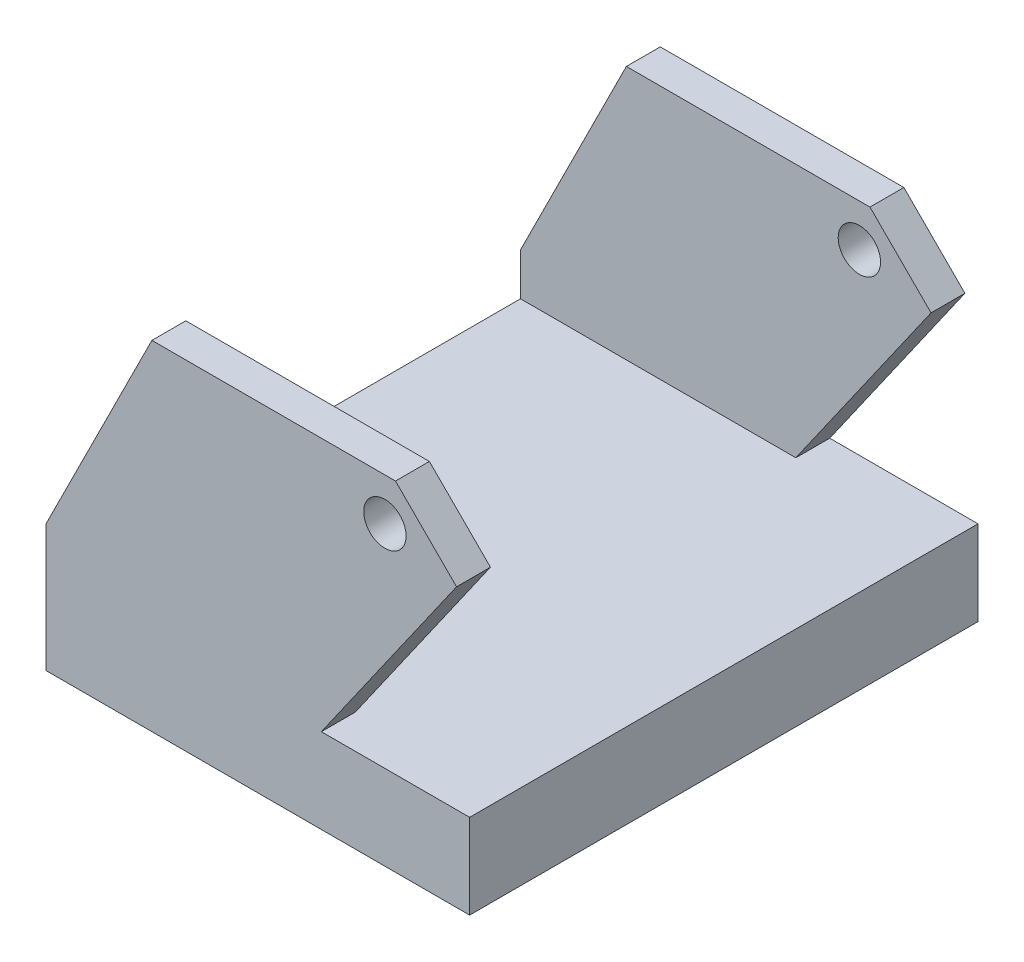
ISO-10303-21;
HEADER;
FILE_DESCRIPTION(('STEP AP214'),'2;1');
FILE_NAME('part.step','',(''),(''),'','','');
FILE_SCHEMA(('AUTOMOTIVE_DESIGN { 1 0 10303 214 1 1 1 1 }'));
ENDSEC;
DATA;
#1=APPLICATION_CONTEXT('core data for automotive mechanical design processes');
#2=APPLICATION_PROTOCOL_DEFINITION('international standard','automotive_design',2000,#1);
#3=PRODUCT_CONTEXT('',#1,'mechanical');
#4=PRODUCT('Part','Part','',(#3));
#5=PRODUCT_RELATED_PRODUCT_CATEGORY('part','',(#4));
#6=PRODUCT_DEFINITION_FORMATION('','',#4);
#7=PRODUCT_DEFINITION_CONTEXT('part definition',#1,'design');
#8=PRODUCT_DEFINITION('design','',#6,#7);
#9=PRODUCT_DEFINITION_SHAPE('','',#8);
#10=(LENGTH_UNIT() NAMED_UNIT(*) SI_UNIT(.MILLI.,.METRE.));
#11=(NAMED_UNIT(*) PLANE_ANGLE_UNIT() SI_UNIT($,.RADIAN.));
#12=(NAMED_UNIT(*) SI_UNIT($,.STERADIAN.) SOLID_ANGLE_UNIT());
#13=UNCERTAINTY_MEASURE_WITH_UNIT(LENGTH_MEASURE(1.E-05),#10,'distance_accuracy_value','');
#14=(GEOMETRIC_REPRESENTATION_CONTEXT(3) GLOBAL_UNCERTAINTY_ASSIGNED_CONTEXT((#13)) GLOBAL_UNIT_ASSIGNED_CONTEXT((#10,
#11,#12)) REPRESENTATION_CONTEXT('',''));
#15=CARTESIAN_POINT('',(0.,0.,0.));
#16=DIRECTION('',(0.,0.,1.));
#17=DIRECTION('',(1.,0.,0.));
#18=AXIS2_PLACEMENT_3D('',#15,#16,#17);
#19=CARTESIAN_POINT('',(50.,0.,-60.));
#20=DIRECTION('',(0.,0.,1.));
#21=DIRECTION('',(1.,0.,0.));
#22=AXIS2_PLACEMENT_3D('',#19,#20,#21);
#23=PLANE('',#22);
#24=CARTESIAN_POINT('',(30.,70.,-60.));
#25=DIRECTION('',(0.,0.,1.));
#26=DIRECTION('',(1.,0.,0.));
#27=AXIS2_PLACEMENT_3D('',#24,#25,#26);
#28=CIRCLE('',#27,5.);
#29=CARTESIAN_POINT('',(35.,70.,-60.));
#30=VERTEX_POINT('',#29);
#31=EDGE_CURVE('E156',#30,#30,#28,.T.);
#32=ORIENTED_EDGE('',*,*,#31,.T.);
#33=EDGE_LOOP('',(#32));
#34=FACE_BOUND('',#33,.T.);
#35=DIRECTION('',(-0.57357643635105,-0.819152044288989,0.));
#36=VECTOR('',#35,1.);
#37=CARTESIAN_POINT('',(46.9173294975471,65.5826705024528,-60.));
#38=LINE('',#37,#36);
#39=CARTESIAN_POINT('',(46.9173294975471,65.5826705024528,-60.));
#40=VERTEX_POINT('',#39);
#41=CARTESIAN_POINT('',(15.,20.,-60.));
#42=VERTEX_POINT('',#41);
#43=EDGE_CURVE('E290',#40,#42,#38,.T.);
#44=ORIENTED_EDGE('',*,*,#43,.T.);
#45=DIRECTION('',(1.,0.,0.));
#46=VECTOR('',#45,1.);
#47=CARTESIAN_POINT('',(15.,20.,-60.));
#48=LINE('',#47,#46);
#49=CARTESIAN_POINT('',(50.,20.,-60.));
#50=VERTEX_POINT('',#49);
#51=EDGE_CURVE('E145',#42,#50,#48,.T.);
#52=ORIENTED_EDGE('',*,*,#51,.T.);
#53=DIRECTION('',(0.,1.,0.));
#54=VECTOR('',#53,1.);
#55=CARTESIAN_POINT('',(50.,0.,-60.));
#56=LINE('',#55,#54);
#57=CARTESIAN_POINT('',(50.,0.,-60.));
#58=VERTEX_POINT('',#57);
#59=EDGE_CURVE('E209',#58,#50,#56,.T.);
#60=ORIENTED_EDGE('',*,*,#59,.F.);
#61=DIRECTION('',(-1.,0.,0.));
#62=VECTOR('',#61,1.);
#63=CARTESIAN_POINT('',(50.,0.,-60.));
#64=LINE('',#63,#62);
#65=CARTESIAN_POINT('',(-50.,0.,-60.));
#66=VERTEX_POINT('',#65);
#67=EDGE_CURVE('E167',#58,#66,#64,.T.);
#68=ORIENTED_EDGE('',*,*,#67,.T.);
#69=DIRECTION('',(0.,1.,0.));
#70=VECTOR('',#69,1.);
#71=CARTESIAN_POINT('',(-50.,0.,-60.));
#72=LINE('',#71,#70);
#73=CARTESIAN_POINT('',(-50.,30.,-60.));
#74=VERTEX_POINT('',#73);
#75=EDGE_CURVE('E198',#66,#74,#72,.T.);
#76=ORIENTED_EDGE('',*,*,#75,.T.);
#77=DIRECTION('',(0.447213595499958,0.894427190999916,0.));
#78=VECTOR('',#77,1.);
#79=CARTESIAN_POINT('',(-25.,80.,-60.));
#80=LINE('',#79,#78);
#81=CARTESIAN_POINT('',(-25.,80.,-60.));
#82=VERTEX_POINT('',#81);
#83=EDGE_CURVE('E189',#74,#82,#80,.T.);
#84=ORIENTED_EDGE('',*,*,#83,.T.);
#85=DIRECTION('',(-1.,0.,0.));
#86=VECTOR('',#85,1.);
#87=CARTESIAN_POINT('',(50.,80.,-60.));
#88=LINE('',#87,#86);
#89=CARTESIAN_POINT('',(32.5,80.,-60.));
#90=VERTEX_POINT('',#89);
#91=EDGE_CURVE('E40',#90,#82,#88,.T.);
#92=ORIENTED_EDGE('',*,*,#91,.F.);
#93=DIRECTION('',(0.707106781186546,-0.707106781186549,0.));
#94=VECTOR('',#93,1.);
#95=CARTESIAN_POINT('',(46.9173294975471,65.5826705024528,-60.));
#96=LINE('',#95,#94);
#97=EDGE_CURVE('E288',#90,#40,#96,.T.);
#98=ORIENTED_EDGE('',*,*,#97,.T.);
#99=EDGE_LOOP('',(#44,#52,#60,#68,#76,#84,#92,#98));
#100=FACE_BOUND('',#99,.T.);
#101=ADVANCED_FACE('F33',(#34,#100),#23,.F.);
#102=CARTESIAN_POINT('',(50.,80.,-60.));
#103=DIRECTION('',(0.,-1.,0.));
#104=DIRECTION('',(0.,0.,-1.));
#105=AXIS2_PLACEMENT_3D('',#102,#103,#104);
#106=PLANE('',#105);
#107=DIRECTION('',(-1.,0.,0.));
#108=VECTOR('',#107,1.);
#109=CARTESIAN_POINT('',(50.,80.,-52.));
#110=LINE('',#109,#108);
#111=CARTESIAN_POINT('',(32.5,80.,-52.));
#112=VERTEX_POINT('',#111);
#113=CARTESIAN_POINT('',(-25.,80.,-52.));
#114=VERTEX_POINT('',#113);
#115=EDGE_CURVE('E174',#112,#114,#110,.T.);
#116=ORIENTED_EDGE('',*,*,#115,.F.);
#117=DIRECTION('',(0.,0.,1.));
#118=VECTOR('',#117,1.);
#119=CARTESIAN_POINT('',(32.5,80.,-60.));
#120=LINE('',#119,#118);
#121=EDGE_CURVE('E144',#90,#112,#120,.T.);
#122=ORIENTED_EDGE('',*,*,#121,.F.);
#123=ORIENTED_EDGE('',*,*,#91,.T.);
#124=DIRECTION('',(0.,0.,1.));
#125=VECTOR('',#124,1.);
#126=CARTESIAN_POINT('',(-25.,80.,-60.));
#127=LINE('',#126,#125);
#128=EDGE_CURVE('E182',#82,#114,#127,.T.);
#129=ORIENTED_EDGE('',*,*,#128,.T.);
#130=EDGE_LOOP('',(#116,#122,#123,#129));
#131=FACE_BOUND('',#130,.T.);
#132=ADVANCED_FACE('F181',(#131),#106,.F.);
#133=CARTESIAN_POINT('',(50.,80.,-52.));
#134=DIRECTION('',(0.,0.,-1.));
#135=DIRECTION('',(0.,1.,0.));
#136=AXIS2_PLACEMENT_3D('',#133,#134,#135);
#137=PLANE('',#136);
#138=CARTESIAN_POINT('',(30.,70.,-52.));
#139=DIRECTION('',(0.,0.,-1.));
#140=DIRECTION('',(0.,1.,0.));
#141=AXIS2_PLACEMENT_3D('',#138,#139,#140);
#142=CIRCLE('',#141,5.);
#143=CARTESIAN_POINT('',(30.,75.,-52.));
#144=VERTEX_POINT('',#143);
#145=EDGE_CURVE('E203',#144,#144,#142,.T.);
#146=ORIENTED_EDGE('',*,*,#145,.T.);
#147=EDGE_LOOP('',(#146));
#148=FACE_BOUND('',#147,.T.);
#149=DIRECTION('',(-1.,0.,0.));
#150=VECTOR('',#149,1.);
#151=CARTESIAN_POINT('',(50.,20.,-52.));
#152=LINE('',#151,#150);
#153=CARTESIAN_POINT('',(15.,20.,-52.));
#154=VERTEX_POINT('',#153);
#155=CARTESIAN_POINT('',(-50.,20.,-52.));
#156=VERTEX_POINT('',#155);
#157=EDGE_CURVE('E172',#154,#156,#152,.T.);
#158=ORIENTED_EDGE('',*,*,#157,.F.);
#159=DIRECTION('',(0.57357643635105,0.819152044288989,0.));
#160=VECTOR('',#159,1.);
#161=CARTESIAN_POINT('',(54.7054261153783,76.7052251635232,-52.));
#162=LINE('',#161,#160);
#163=CARTESIAN_POINT('',(46.9173294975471,65.5826705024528,-52.));
#164=VERTEX_POINT('',#163);
#165=EDGE_CURVE('E246',#154,#164,#162,.T.);
#166=ORIENTED_EDGE('',*,*,#165,.T.);
#167=DIRECTION('',(-0.707106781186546,0.707106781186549,0.));
#168=VECTOR('',#167,1.);
#169=CARTESIAN_POINT('',(41.25,71.25,-52.));
#170=LINE('',#169,#168);
#171=EDGE_CURVE('E245',#164,#112,#170,.T.);
#172=ORIENTED_EDGE('',*,*,#171,.T.);
#173=ORIENTED_EDGE('',*,*,#115,.T.);
#174=DIRECTION('',(-0.447213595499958,-0.894427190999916,0.));
#175=VECTOR('',#174,1.);
#176=CARTESIAN_POINT('',(-10.,110.,-52.));
#177=LINE('',#176,#175);
#178=CARTESIAN_POINT('',(-50.,30.,-52.));
#179=VERTEX_POINT('',#178);
#180=EDGE_CURVE('E192',#114,#179,#177,.T.);
#181=ORIENTED_EDGE('',*,*,#180,.T.);
#182=DIRECTION('',(0.,-1.,0.));
#183=VECTOR('',#182,1.);
#184=CARTESIAN_POINT('',(-50.,80.,-52.));
#185=LINE('',#184,#183);
#186=EDGE_CURVE('E218',#179,#156,#185,.T.);
#187=ORIENTED_EDGE('',*,*,#186,.T.);
#188=EDGE_LOOP('',(#158,#166,#172,#173,#181,#187));
#189=FACE_BOUND('',#188,.T.);
#190=ADVANCED_FACE('F242',(#148,#189),#137,.F.);
#191=CARTESIAN_POINT('',(50.,20.,-52.));
#192=DIRECTION('',(0.,-1.,0.));
#193=DIRECTION('',(0.,0.,-1.));
#194=AXIS2_PLACEMENT_3D('',#191,#192,#193);
#195=PLANE('',#194);
#196=DIRECTION('',(-1.,0.,0.));
#197=VECTOR('',#196,1.);
#198=CARTESIAN_POINT('',(50.,20.,52.));
#199=LINE('',#198,#197);
#200=CARTESIAN_POINT('',(15.,20.,52.));
#201=VERTEX_POINT('',#200);
#202=CARTESIAN_POINT('',(-50.,20.,52.));
#203=VERTEX_POINT('',#202);
#204=EDGE_CURVE('E164',#201,#203,#199,.T.);
#205=ORIENTED_EDGE('',*,*,#204,.F.);
#206=DIRECTION('',(0.,0.,1.));
#207=VECTOR('',#206,1.);
#208=CARTESIAN_POINT('',(15.,20.,-60.));
#209=LINE('',#208,#207);
#210=CARTESIAN_POINT('',(15.,20.,60.));
#211=VERTEX_POINT('',#210);
#212=EDGE_CURVE('E295',#201,#211,#209,.T.);
#213=ORIENTED_EDGE('',*,*,#212,.T.);
#214=DIRECTION('',(1.,0.,0.));
#215=VECTOR('',#214,1.);
#216=CARTESIAN_POINT('',(15.,20.,60.));
#217=LINE('',#216,#215);
#218=CARTESIAN_POINT('',(50.,20.,60.));
#219=VERTEX_POINT('',#218);
#220=EDGE_CURVE('E286',#211,#219,#217,.T.);
#221=ORIENTED_EDGE('',*,*,#220,.T.);
#222=DIRECTION('',(0.,0.,1.));
#223=VECTOR('',#222,1.);
#224=CARTESIAN_POINT('',(50.,20.,-52.));
#225=LINE('',#224,#223);
#226=EDGE_CURVE('E47',#50,#219,#225,.T.);
#227=ORIENTED_EDGE('',*,*,#226,.F.);
#228=ORIENTED_EDGE('',*,*,#51,.F.);
#229=EDGE_CURVE('E253',#42,#154,#209,.T.);
#230=ORIENTED_EDGE('',*,*,#229,.T.);
#231=ORIENTED_EDGE('',*,*,#157,.T.);
#232=DIRECTION('',(0.,0.,1.));
#233=VECTOR('',#232,1.);
#234=CARTESIAN_POINT('',(-50.,20.,-52.));
#235=LINE('',#234,#233);
#236=EDGE_CURVE('E221',#156,#203,#235,.T.);
#237=ORIENTED_EDGE('',*,*,#236,.T.);
#238=EDGE_LOOP('',(#205,#213,#221,#227,#228,#230,#231,#237));
#239=FACE_BOUND('',#238,.T.);
#240=ADVANCED_FACE('F307',(#239),#195,.F.);
#241=CARTESIAN_POINT('',(50.,80.,52.));
#242=DIRECTION('',(0.,0.,1.));
#243=DIRECTION('',(0.,-1.,0.));
#244=AXIS2_PLACEMENT_3D('',#241,#242,#243);
#245=PLANE('',#244);
#246=CARTESIAN_POINT('',(30.,70.,52.));
#247=DIRECTION('',(0.,0.,1.));
#248=DIRECTION('',(0.,-1.,0.));
#249=AXIS2_PLACEMENT_3D('',#246,#247,#248);
#250=CIRCLE('',#249,5.);
#251=CARTESIAN_POINT('',(30.,65.,52.));
#252=VERTEX_POINT('',#251);
#253=EDGE_CURVE('E257',#252,#252,#250,.T.);
#254=ORIENTED_EDGE('',*,*,#253,.T.);
#255=EDGE_LOOP('',(#254));
#256=FACE_BOUND('',#255,.T.);
#257=DIRECTION('',(0.707106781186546,-0.707106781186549,0.));
#258=VECTOR('',#257,1.);
#259=CARTESIAN_POINT('',(41.25,71.25,52.));
#260=LINE('',#259,#258);
#261=CARTESIAN_POINT('',(32.5,80.,52.));
#262=VERTEX_POINT('',#261);
#263=CARTESIAN_POINT('',(46.9173294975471,65.5826705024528,52.));
#264=VERTEX_POINT('',#263);
#265=EDGE_CURVE('E140',#262,#264,#260,.T.);
#266=ORIENTED_EDGE('',*,*,#265,.T.);
#267=DIRECTION('',(-0.57357643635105,-0.819152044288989,0.));
#268=VECTOR('',#267,1.);
#269=CARTESIAN_POINT('',(54.7054261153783,76.7052251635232,52.));
#270=LINE('',#269,#268);
#271=EDGE_CURVE('E249',#264,#201,#270,.T.);
#272=ORIENTED_EDGE('',*,*,#271,.T.);
#273=ORIENTED_EDGE('',*,*,#204,.T.);
#274=DIRECTION('',(0.,1.,0.));
#275=VECTOR('',#274,1.);
#276=CARTESIAN_POINT('',(-50.,80.,52.));
#277=LINE('',#276,#275);
#278=CARTESIAN_POINT('',(-50.,30.,52.));
#279=VERTEX_POINT('',#278);
#280=EDGE_CURVE('E224',#203,#279,#277,.T.);
#281=ORIENTED_EDGE('',*,*,#280,.T.);
#282=DIRECTION('',(0.447213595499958,0.894427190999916,0.));
#283=VECTOR('',#282,1.);
#284=CARTESIAN_POINT('',(-10.,110.,52.));
#285=LINE('',#284,#283);
#286=CARTESIAN_POINT('',(-25.,80.,52.));
#287=VERTEX_POINT('',#286);
#288=EDGE_CURVE('E55',#279,#287,#285,.T.);
#289=ORIENTED_EDGE('',*,*,#288,.T.);
#290=DIRECTION('',(-1.,0.,0.));
#291=VECTOR('',#290,1.);
#292=CARTESIAN_POINT('',(50.,80.,52.));
#293=LINE('',#292,#291);
#294=EDGE_CURVE('E161',#262,#287,#293,.T.);
#295=ORIENTED_EDGE('',*,*,#294,.F.);
#296=EDGE_LOOP('',(#266,#272,#273,#281,#289,#295));
#297=FACE_BOUND('',#296,.T.);
#298=ADVANCED_FACE('F301',(#256,#297),#245,.F.);
#299=CARTESIAN_POINT('',(50.,80.,60.));
#300=DIRECTION('',(0.,-1.,0.));
#301=DIRECTION('',(0.,0.,-1.));
#302=AXIS2_PLACEMENT_3D('',#299,#300,#301);
#303=PLANE('',#302);
#304=DIRECTION('',(-1.,0.,0.));
#305=VECTOR('',#304,1.);
#306=CARTESIAN_POINT('',(50.,80.,60.));
#307=LINE('',#306,#305);
#308=CARTESIAN_POINT('',(32.5,80.,60.));
#309=VERTEX_POINT('',#308);
#310=CARTESIAN_POINT('',(-25.,80.,60.));
#311=VERTEX_POINT('',#310);
#312=EDGE_CURVE('E151',#309,#311,#307,.T.);
#313=ORIENTED_EDGE('',*,*,#312,.F.);
#314=EDGE_CURVE('E133',#262,#309,#120,.T.);
#315=ORIENTED_EDGE('',*,*,#314,.F.);
#316=ORIENTED_EDGE('',*,*,#294,.T.);
#317=EDGE_CURVE('E160',#287,#311,#127,.T.);
#318=ORIENTED_EDGE('',*,*,#317,.T.);
#319=EDGE_LOOP('',(#313,#315,#316,#318));
#320=FACE_BOUND('',#319,.T.);
#321=ADVANCED_FACE('F159',(#320),#303,.F.);
#322=CARTESIAN_POINT('',(50.,0.,60.));
#323=DIRECTION('',(0.,0.,-1.));
#324=DIRECTION('',(-1.,0.,0.));
#325=AXIS2_PLACEMENT_3D('',#322,#323,#324);
#326=PLANE('',#325);
#327=CARTESIAN_POINT('',(30.,70.,60.));
#328=DIRECTION('',(0.,0.,1.));
#329=DIRECTION('',(1.,0.,0.));
#330=AXIS2_PLACEMENT_3D('',#327,#328,#329);
#331=CIRCLE('',#330,5.);
#332=CARTESIAN_POINT('',(35.,70.,60.));
#333=VERTEX_POINT('',#332);
#334=EDGE_CURVE('E280',#333,#333,#331,.T.);
#335=ORIENTED_EDGE('',*,*,#334,.F.);
#336=EDGE_LOOP('',(#335));
#337=FACE_BOUND('',#336,.T.);
#338=DIRECTION('',(0.,-1.,0.));
#339=VECTOR('',#338,1.);
#340=CARTESIAN_POINT('',(50.,0.,60.));
#341=LINE('',#340,#339);
#342=CARTESIAN_POINT('',(50.,0.,60.));
#343=VERTEX_POINT('',#342);
#344=EDGE_CURVE('E213',#219,#343,#341,.T.);
#345=ORIENTED_EDGE('',*,*,#344,.F.);
#346=ORIENTED_EDGE('',*,*,#220,.F.);
#347=DIRECTION('',(-0.57357643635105,-0.819152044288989,0.));
#348=VECTOR('',#347,1.);
#349=CARTESIAN_POINT('',(46.9173294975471,65.5826705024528,60.));
#350=LINE('',#349,#348);
#351=CARTESIAN_POINT('',(46.9173294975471,65.5826705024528,60.));
#352=VERTEX_POINT('',#351);
#353=EDGE_CURVE('E155',#352,#211,#350,.T.);
#354=ORIENTED_EDGE('',*,*,#353,.F.);
#355=DIRECTION('',(0.707106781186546,-0.707106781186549,0.));
#356=VECTOR('',#355,1.);
#357=CARTESIAN_POINT('',(46.9173294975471,65.5826705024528,60.));
#358=LINE('',#357,#356);
#359=EDGE_CURVE('E137',#309,#352,#358,.T.);
#360=ORIENTED_EDGE('',*,*,#359,.F.);
#361=ORIENTED_EDGE('',*,*,#312,.T.);
#362=DIRECTION('',(0.447213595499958,0.894427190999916,0.));
#363=VECTOR('',#362,1.);
#364=CARTESIAN_POINT('',(-25.,80.,60.));
#365=LINE('',#364,#363);
#366=CARTESIAN_POINT('',(-50.,30.,60.));
#367=VERTEX_POINT('',#366);
#368=EDGE_CURVE('E200',#367,#311,#365,.T.);
#369=ORIENTED_EDGE('',*,*,#368,.F.);
#370=DIRECTION('',(0.,-1.,0.));
#371=VECTOR('',#370,1.);
#372=CARTESIAN_POINT('',(-50.,0.,60.));
#373=LINE('',#372,#371);
#374=CARTESIAN_POINT('',(-50.,0.,60.));
#375=VERTEX_POINT('',#374);
#376=EDGE_CURVE('E227',#367,#375,#373,.T.);
#377=ORIENTED_EDGE('',*,*,#376,.T.);
#378=DIRECTION('',(-1.,0.,0.));
#379=VECTOR('',#378,1.);
#380=CARTESIAN_POINT('',(50.,0.,60.));
#381=LINE('',#380,#379);
#382=EDGE_CURVE('E162',#343,#375,#381,.T.);
#383=ORIENTED_EDGE('',*,*,#382,.F.);
#384=EDGE_LOOP('',(#345,#346,#354,#360,#361,#369,#377,#383));
#385=FACE_BOUND('',#384,.T.);
#386=ADVANCED_FACE('F149',(#337,#385),#326,.F.);
#387=CARTESIAN_POINT('',(50.,0.,60.));
#388=DIRECTION('',(0.,1.,0.));
#389=DIRECTION('',(0.,0.,1.));
#390=AXIS2_PLACEMENT_3D('',#387,#388,#389);
#391=PLANE('',#390);
#392=DIRECTION('',(0.,0.,-1.));
#393=VECTOR('',#392,1.);
#394=CARTESIAN_POINT('',(-50.,0.,60.));
#395=LINE('',#394,#393);
#396=EDGE_CURVE('E211',#375,#66,#395,.T.);
#397=ORIENTED_EDGE('',*,*,#396,.T.);
#398=ORIENTED_EDGE('',*,*,#67,.F.);
#399=DIRECTION('',(0.,0.,-1.));
#400=VECTOR('',#399,1.);
#401=CARTESIAN_POINT('',(50.,0.,60.));
#402=LINE('',#401,#400);
#403=EDGE_CURVE('E215',#343,#58,#402,.T.);
#404=ORIENTED_EDGE('',*,*,#403,.F.);
#405=ORIENTED_EDGE('',*,*,#382,.T.);
#406=EDGE_LOOP('',(#397,#398,#404,#405));
#407=FACE_BOUND('',#406,.T.);
#408=ADVANCED_FACE('F314',(#407),#391,.F.);
#409=CARTESIAN_POINT('',(50.,0.,0.));
#410=DIRECTION('',(1.,0.,0.));
#411=DIRECTION('',(0.,0.,-1.));
#412=AXIS2_PLACEMENT_3D('',#409,#410,#411);
#413=PLANE('',#412);
#414=ORIENTED_EDGE('',*,*,#226,.T.);
#415=ORIENTED_EDGE('',*,*,#344,.T.);
#416=ORIENTED_EDGE('',*,*,#403,.T.);
#417=ORIENTED_EDGE('',*,*,#59,.T.);
#418=EDGE_LOOP('',(#414,#415,#416,#417));
#419=FACE_BOUND('',#418,.T.);
#420=ADVANCED_FACE('F313',(#419),#413,.T.);
#421=CARTESIAN_POINT('',(-50.,0.,0.));
#422=DIRECTION('',(1.,0.,0.));
#423=DIRECTION('',(0.,0.,-1.));
#424=AXIS2_PLACEMENT_3D('',#421,#422,#423);
#425=PLANE('',#424);
#426=ORIENTED_EDGE('',*,*,#376,.F.);
#427=DIRECTION('',(0.,0.,-1.));
#428=VECTOR('',#427,1.);
#429=CARTESIAN_POINT('',(-50.,30.,0.));
#430=LINE('',#429,#428);
#431=EDGE_CURVE('E11',#367,#279,#430,.T.);
#432=ORIENTED_EDGE('',*,*,#431,.T.);
#433=ORIENTED_EDGE('',*,*,#280,.F.);
#434=ORIENTED_EDGE('',*,*,#236,.F.);
#435=ORIENTED_EDGE('',*,*,#186,.F.);
#436=DIRECTION('',(0.,0.,1.));
#437=VECTOR('',#436,1.);
#438=CARTESIAN_POINT('',(-50.,30.,-60.));
#439=LINE('',#438,#437);
#440=EDGE_CURVE('E199',#74,#179,#439,.T.);
#441=ORIENTED_EDGE('',*,*,#440,.F.);
#442=ORIENTED_EDGE('',*,*,#75,.F.);
#443=ORIENTED_EDGE('',*,*,#396,.F.);
#444=EDGE_LOOP('',(#426,#432,#433,#434,#435,#441,#442,#443));
#445=FACE_BOUND('',#444,.T.);
#446=ADVANCED_FACE('F237',(#445),#425,.F.);
#447=CARTESIAN_POINT('',(-25.,80.,-60.));
#448=DIRECTION('',(0.894427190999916,-0.447213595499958,0.));
#449=DIRECTION('',(0.447213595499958,0.894427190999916,0.));
#450=AXIS2_PLACEMENT_3D('',#447,#448,#449);
#451=PLANE('',#450);
#452=ORIENTED_EDGE('',*,*,#128,.F.);
#453=ORIENTED_EDGE('',*,*,#83,.F.);
#454=ORIENTED_EDGE('',*,*,#440,.T.);
#455=ORIENTED_EDGE('',*,*,#180,.F.);
#456=EDGE_LOOP('',(#452,#453,#454,#455));
#457=FACE_BOUND('',#456,.T.);
#458=ADVANCED_FACE('F188',(#457),#451,.F.);
#459=ORIENTED_EDGE('',*,*,#431,.F.);
#460=ORIENTED_EDGE('',*,*,#368,.T.);
#461=ORIENTED_EDGE('',*,*,#317,.F.);
#462=ORIENTED_EDGE('',*,*,#288,.F.);
#463=EDGE_LOOP('',(#459,#460,#461,#462));
#464=FACE_BOUND('',#463,.T.);
#465=ADVANCED_FACE('F303',(#464),#451,.F.);
#466=CARTESIAN_POINT('',(46.9173294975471,65.5826705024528,-60.));
#467=DIRECTION('',(-0.707106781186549,-0.707106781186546,0.));
#468=DIRECTION('',(0.707106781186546,-0.707106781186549,0.));
#469=AXIS2_PLACEMENT_3D('',#466,#467,#468);
#470=PLANE('',#469);
#471=DIRECTION('',(0.,0.,1.));
#472=VECTOR('',#471,1.);
#473=CARTESIAN_POINT('',(46.9173294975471,65.5826705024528,-60.));
#474=LINE('',#473,#472);
#475=EDGE_CURVE('E296',#40,#164,#474,.T.);
#476=ORIENTED_EDGE('',*,*,#475,.F.);
#477=ORIENTED_EDGE('',*,*,#97,.F.);
#478=ORIENTED_EDGE('',*,*,#121,.T.);
#479=ORIENTED_EDGE('',*,*,#171,.F.);
#480=EDGE_LOOP('',(#476,#477,#478,#479));
#481=FACE_BOUND('',#480,.T.);
#482=ADVANCED_FACE('F312',(#481),#470,.F.);
#483=CARTESIAN_POINT('',(46.9173294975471,65.5826705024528,-60.));
#484=DIRECTION('',(-0.819152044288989,0.57357643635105,0.));
#485=DIRECTION('',(-0.57357643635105,-0.819152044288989,0.));
#486=AXIS2_PLACEMENT_3D('',#483,#484,#485);
#487=PLANE('',#486);
#488=ORIENTED_EDGE('',*,*,#229,.F.);
#489=ORIENTED_EDGE('',*,*,#43,.F.);
#490=ORIENTED_EDGE('',*,*,#475,.T.);
#491=ORIENTED_EDGE('',*,*,#165,.F.);
#492=EDGE_LOOP('',(#488,#489,#490,#491));
#493=FACE_BOUND('',#492,.T.);
#494=ADVANCED_FACE('F311',(#493),#487,.F.);
#495=EDGE_CURVE('E297',#264,#352,#474,.T.);
#496=ORIENTED_EDGE('',*,*,#495,.T.);
#497=ORIENTED_EDGE('',*,*,#353,.T.);
#498=ORIENTED_EDGE('',*,*,#212,.F.);
#499=ORIENTED_EDGE('',*,*,#271,.F.);
#500=EDGE_LOOP('',(#496,#497,#498,#499));
#501=FACE_BOUND('',#500,.T.);
#502=ADVANCED_FACE('F299',(#501),#487,.F.);
#503=ORIENTED_EDGE('',*,*,#314,.T.);
#504=ORIENTED_EDGE('',*,*,#359,.T.);
#505=ORIENTED_EDGE('',*,*,#495,.F.);
#506=ORIENTED_EDGE('',*,*,#265,.F.);
#507=EDGE_LOOP('',(#503,#504,#505,#506));
#508=FACE_BOUND('',#507,.T.);
#509=ADVANCED_FACE('F135',(#508),#470,.F.);
#510=CARTESIAN_POINT('',(30.,70.,-60.));
#511=DIRECTION('',(0.,0.,1.));
#512=DIRECTION('',(1.,0.,0.));
#513=AXIS2_PLACEMENT_3D('',#510,#511,#512);
#514=CYLINDRICAL_SURFACE('',#513,5.);
#515=ORIENTED_EDGE('',*,*,#334,.T.);
#516=EDGE_LOOP('',(#515));
#517=FACE_BOUND('',#516,.T.);
#518=ORIENTED_EDGE('',*,*,#253,.F.);
#519=EDGE_LOOP('',(#518));
#520=FACE_BOUND('',#519,.T.);
#521=ADVANCED_FACE('F265',(#517,#520),#514,.F.);
#522=ORIENTED_EDGE('',*,*,#31,.F.);
#523=EDGE_LOOP('',(#522));
#524=FACE_BOUND('',#523,.T.);
#525=ORIENTED_EDGE('',*,*,#145,.F.);
#526=EDGE_LOOP('',(#525));
#527=FACE_BOUND('',#526,.T.);
#528=ADVANCED_FACE('F263',(#524,#527),#514,.F.);
#529=CLOSED_SHELL('',(#101,#132,#190,#240,#298,#321,#386,#408,#420,#446,#458,#465,#482,#494,
#502,#509,#521,#528));
#530=MANIFOLD_SOLID_BREP('B2',#529);
#531=ADVANCED_BREP_SHAPE_REPRESENTATION('',(#18,#530),#14);
#532=SHAPE_DEFINITION_REPRESENTATION(#9,#531);
ENDSEC;
END-ISO-10303-21;
